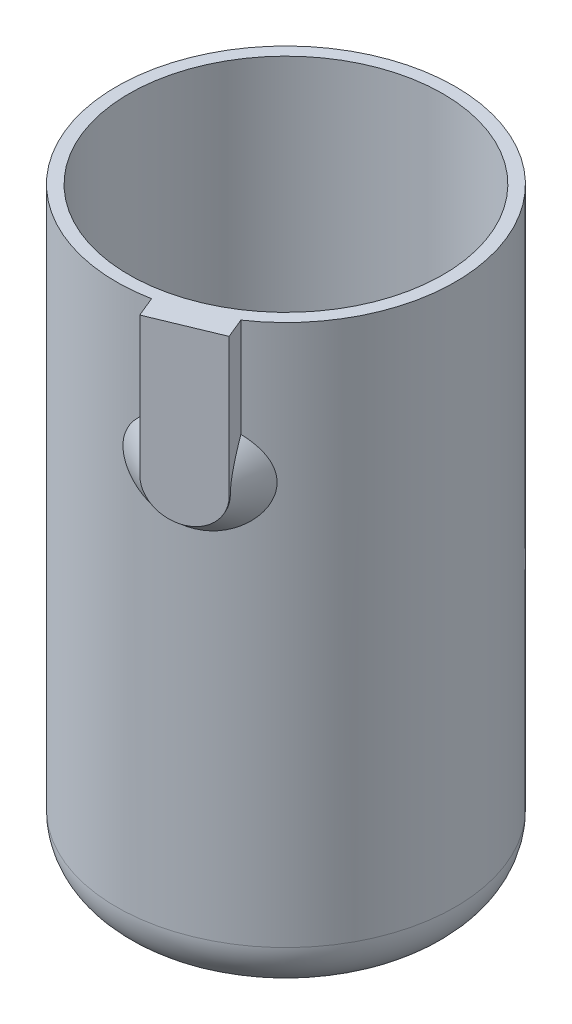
from build123d import *

# Parameters (mm, degrees)
EXTRUDE_1_DEPTH = 4
SKETCH_4_W      = 5
SKETCH_4_H      = 42.55


with BuildPart() as part:
    # Sketch 1 → Revolve 1 (revolve)
    with BuildSketch(Plane.XY, mode=Mode.PRIVATE) as revolve_1_sk:
        with BuildLine():
            Line((0, -93.3), (-9, -93.3))
            ThreePointArc((-9, -93.3), (-9.707106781, -93.007106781), (-10, -92.3))
            Line((-10, -92.3), (-10, -90.3))
            ThreePointArc((-10, -90.3), (-12.588190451, -89.959258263), (-15, -88.960254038))
            Line((-15, -88.960254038), (-15, -95.3))
            Line((-15, -95.3), (-19.05, -95.3))
            ThreePointArc((-19.05, -95.3), (-24.848275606, -92.898275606), (-27.25, -87.1))
            Line((-27.25, -87.1), (-27.25, 0))
            Line((-27.25, 0), (-25.25, 0))
            Line((-25.25, 0), (-25.25, -85.1))
            ThreePointArc((-25.25, -85.1), (-22.848275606, -90.898275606), (-17.05, -93.3))
            Line((-17.05, -93.3), (-17, -93.3))
            Line((-17, -93.3), (-17, -86.960254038))
            Line((-17, -86.960254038), (0, -86.960254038))
            Line((0, -86.960254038), (0, -93.3))
        make_face()
    revolve(revolve_1_sk.sketch.rotate(Axis((0, 0, 0), (0, -1, 0)), 90), axis=Axis((0, 0, 0), (0, -1, 0)))

    # Sketch 2 → Revolve 2 (revolve)
    with BuildSketch(Plane(origin=(0, -22.3, 0), x_dir=(1, 0, 0), z_dir=(0, 1, 0)), mode=Mode.PRIVATE) as revolve_2_sk:
        Polygon((11.403966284, -27.531610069), (6.322628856, -29.636368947), (0.328290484, -26.923822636), (-0.819759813, -24.152184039), (8.419035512, -20.325349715), align=None)
    revolve(revolve_2_sk.sketch.rotate(Axis((8.419035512, -22.3, 20.325349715), (0.3826834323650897, 0, 0.9238795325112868)), 180), axis=Axis((8.419035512, -22.3, 20.325349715), (0.3826834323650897, 0, 0.9238795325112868)))

    # Sketch 3 → Extrude 1 (add)
    with BuildSketch(Plane(origin=(11.545559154, 0, 27.873445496), x_dir=(0.9238795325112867, 0, -0.38268343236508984), z_dir=(0.38268343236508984, 0, 0.9238795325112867))):
        with BuildLine():
            Line((-5.5, 0), (-5.5, -22.3))
            ThreePointArc((-5.5, -22.3), (0, -27.8), (5.5, -22.3))
            Line((5.5, -22.3), (5.5, 0))
            Line((5.5, 0), (-5.5, 0))
        make_face()
    extrude(amount=-EXTRUDE_1_DEPTH)

    # Sketch 4 → Cut-Revolve 1 (revolve, cut)
    with BuildSketch(Plane.XY, mode=Mode.PRIVATE) as cut_revolve_1_sk:
        with Locations((-22.75, -21.275)):
            Rectangle(SKETCH_4_W, SKETCH_4_H)
    revolve(cut_revolve_1_sk.sketch.rotate(Axis((0, 0, 0), (0, -1, 0)), 90), axis=Axis((0, 0, 0), (0, -1, 0)), mode=Mode.SUBTRACT)


solid = part.part
